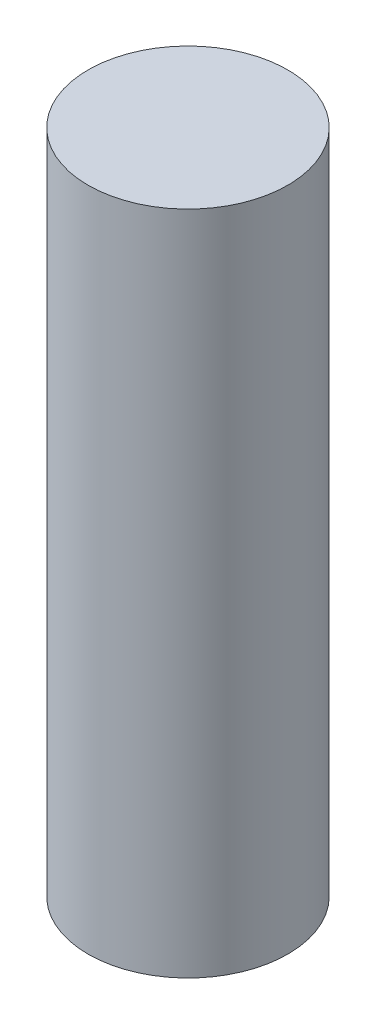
from build123d import *

# Parameters (mm, degrees)
SKETCH1_R           = 15
BOSS_EXTRUDE1_DEPTH = 100


with BuildPart() as part:
    # Sketch1 → Boss-Extrude1 (new body)
    with BuildSketch(Plane(origin=(0, 0, 0), x_dir=(1, 0, 0), z_dir=(0, 1, 0))):
        with Locations(Location((-9.654212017, 1.568809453, 0), (0, 0, 270))):
            Circle(SKETCH1_R)
    extrude(amount=BOSS_EXTRUDE1_DEPTH)


solid = part.part
